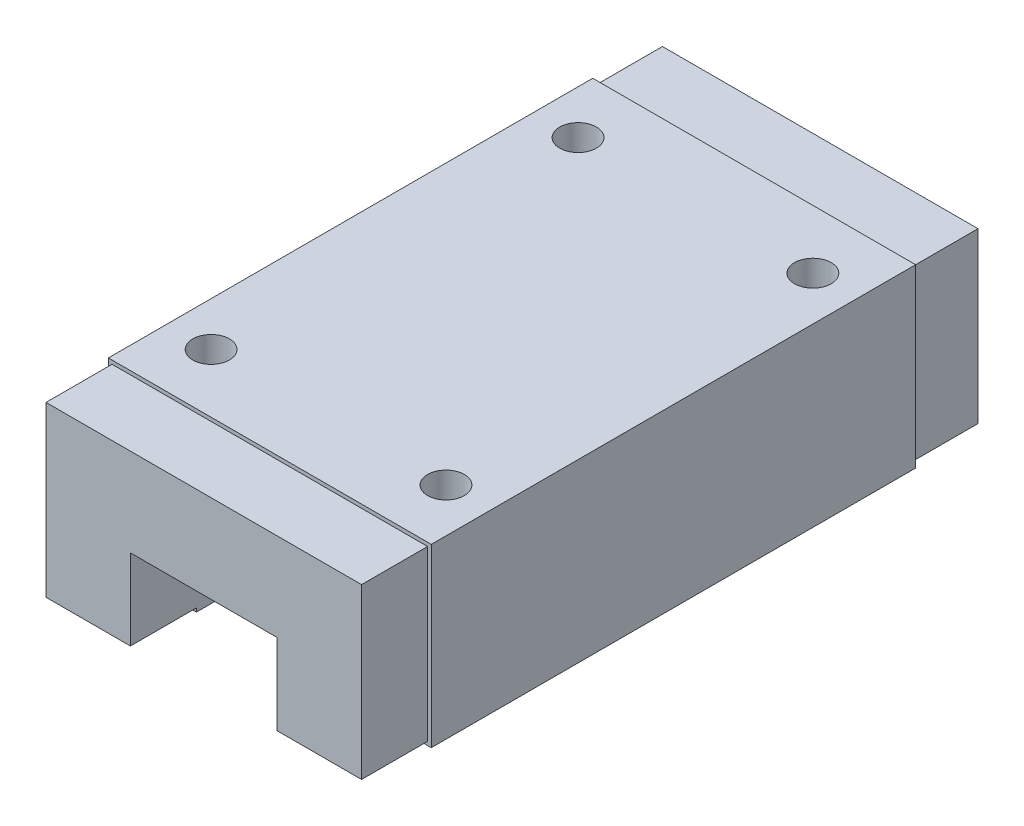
ISO-10303-21;
HEADER;
FILE_DESCRIPTION(('STEP AP214'),'2;1');
FILE_NAME('part.step','',(''),(''),'','','');
FILE_SCHEMA(('AUTOMOTIVE_DESIGN { 1 0 10303 214 1 1 1 1 }'));
ENDSEC;
DATA;
#1=APPLICATION_CONTEXT('core data for automotive mechanical design processes');
#2=APPLICATION_PROTOCOL_DEFINITION('international standard','automotive_design',2000,#1);
#3=PRODUCT_CONTEXT('',#1,'mechanical');
#4=PRODUCT('Part','Part','',(#3));
#5=PRODUCT_RELATED_PRODUCT_CATEGORY('part','',(#4));
#6=PRODUCT_DEFINITION_FORMATION('','',#4);
#7=PRODUCT_DEFINITION_CONTEXT('part definition',#1,'design');
#8=PRODUCT_DEFINITION('design','',#6,#7);
#9=PRODUCT_DEFINITION_SHAPE('','',#8);
#10=(LENGTH_UNIT() NAMED_UNIT(*) SI_UNIT(.MILLI.,.METRE.));
#11=(NAMED_UNIT(*) PLANE_ANGLE_UNIT() SI_UNIT($,.RADIAN.));
#12=(NAMED_UNIT(*) SI_UNIT($,.STERADIAN.) SOLID_ANGLE_UNIT());
#13=UNCERTAINTY_MEASURE_WITH_UNIT(LENGTH_MEASURE(1.E-05),#10,'distance_accuracy_value','');
#14=(GEOMETRIC_REPRESENTATION_CONTEXT(3) GLOBAL_UNCERTAINTY_ASSIGNED_CONTEXT((#13)) GLOBAL_UNIT_ASSIGNED_CONTEXT((#10,
#11,#12)) REPRESENTATION_CONTEXT('',''));
#15=CARTESIAN_POINT('',(0.,0.,0.));
#16=DIRECTION('',(0.,0.,1.));
#17=DIRECTION('',(1.,0.,0.));
#18=AXIS2_PLACEMENT_3D('',#15,#16,#17);
#19=CARTESIAN_POINT('',(-21.9999999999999,-12.,32.9999999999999));
#20=DIRECTION('',(0.,1.,0.));
#21=DIRECTION('',(0.,0.,0.999999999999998));
#22=AXIS2_PLACEMENT_3D('',#19,#20,#21);
#23=PLANE('',#22);
#24=DIRECTION('',(-0.999999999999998,0.,0.));
#25=VECTOR('',#24,1.);
#26=CARTESIAN_POINT('',(-22.,-12.,-32.9999999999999));
#27=LINE('',#26,#25);
#28=CARTESIAN_POINT('',(-9.99999999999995,-12.,-32.9999999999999));
#29=VERTEX_POINT('',#28);
#30=CARTESIAN_POINT('',(-22.,-12.,-32.9999999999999));
#31=VERTEX_POINT('',#30);
#32=EDGE_CURVE('E363',#29,#31,#27,.T.);
#33=ORIENTED_EDGE('',*,*,#32,.F.);
#34=DIRECTION('',(0.,0.,0.999999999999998));
#35=VECTOR('',#34,1.);
#36=CARTESIAN_POINT('',(-9.99999999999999,-12.,-42.0009999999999));
#37=LINE('',#36,#35);
#38=CARTESIAN_POINT('',(-9.99999999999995,-12.,32.9999999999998));
#39=VERTEX_POINT('',#38);
#40=EDGE_CURVE('E261',#29,#39,#37,.T.);
#41=ORIENTED_EDGE('',*,*,#40,.T.);
#42=DIRECTION('',(0.999999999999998,0.,0.));
#43=VECTOR('',#42,1.);
#44=CARTESIAN_POINT('',(-21.9999999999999,-12.,32.9999999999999));
#45=LINE('',#44,#43);
#46=CARTESIAN_POINT('',(-21.9999999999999,-12.,32.9999999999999));
#47=VERTEX_POINT('',#46);
#48=EDGE_CURVE('E358',#47,#39,#45,.T.);
#49=ORIENTED_EDGE('',*,*,#48,.F.);
#50=DIRECTION('',(0.,0.,0.999999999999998));
#51=VECTOR('',#50,1.);
#52=CARTESIAN_POINT('',(-22.,-12.,-32.9999999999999));
#53=LINE('',#52,#51);
#54=EDGE_CURVE('E343',#31,#47,#53,.T.);
#55=ORIENTED_EDGE('',*,*,#54,.F.);
#56=EDGE_LOOP('',(#33,#41,#49,#55));
#57=FACE_BOUND('',#56,.T.);
#58=ADVANCED_FACE('F31',(#57),#23,.F.);
#59=CARTESIAN_POINT('',(-21.5,-11.5000000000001,41.9999999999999));
#60=DIRECTION('',(0.,1.,0.));
#61=DIRECTION('',(0.,0.,0.999999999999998));
#62=AXIS2_PLACEMENT_3D('',#59,#60,#61);
#63=PLANE('',#62);
#64=DIRECTION('',(0.999999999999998,0.,0.));
#65=VECTOR('',#64,1.);
#66=CARTESIAN_POINT('',(-21.4999999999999,-11.5,32.9999999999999));
#67=LINE('',#66,#65);
#68=CARTESIAN_POINT('',(-21.4999999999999,-11.5,32.9999999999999));
#69=VERTEX_POINT('',#68);
#70=CARTESIAN_POINT('',(-9.99999999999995,-11.5,32.9999999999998));
#71=VERTEX_POINT('',#70);
#72=EDGE_CURVE('E324',#69,#71,#67,.T.);
#73=ORIENTED_EDGE('',*,*,#72,.T.);
#74=DIRECTION('',(0.,0.,-0.999999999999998));
#75=VECTOR('',#74,1.);
#76=CARTESIAN_POINT('',(-9.99999999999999,-11.5,-42.0009999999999));
#77=LINE('',#76,#75);
#78=CARTESIAN_POINT('',(-9.99999999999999,-11.5,41.9999999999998));
#79=VERTEX_POINT('',#78);
#80=EDGE_CURVE('E237',#79,#71,#77,.T.);
#81=ORIENTED_EDGE('',*,*,#80,.F.);
#82=DIRECTION('',(0.999999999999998,0.,0.));
#83=VECTOR('',#82,1.);
#84=CARTESIAN_POINT('',(-21.5,-11.5000000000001,41.9999999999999));
#85=LINE('',#84,#83);
#86=CARTESIAN_POINT('',(-21.5,-11.5000000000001,41.9999999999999));
#87=VERTEX_POINT('',#86);
#88=EDGE_CURVE('E313',#87,#79,#85,.T.);
#89=ORIENTED_EDGE('',*,*,#88,.F.);
#90=DIRECTION('',(0.,0.,-0.999999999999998));
#91=VECTOR('',#90,1.);
#92=CARTESIAN_POINT('',(-21.5,-11.5000000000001,41.9999999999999));
#93=LINE('',#92,#91);
#94=EDGE_CURVE('E340',#87,#69,#93,.T.);
#95=ORIENTED_EDGE('',*,*,#94,.T.);
#96=EDGE_LOOP('',(#73,#81,#89,#95));
#97=FACE_BOUND('',#96,.T.);
#98=ADVANCED_FACE('F439',(#97),#63,.F.);
#99=CARTESIAN_POINT('',(-21.5,-11.4999999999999,-41.9999999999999));
#100=DIRECTION('',(0.,1.,0.));
#101=DIRECTION('',(-0.999999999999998,0.,0.));
#102=AXIS2_PLACEMENT_3D('',#99,#100,#101);
#103=PLANE('',#102);
#104=DIRECTION('',(-0.999999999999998,0.,0.));
#105=VECTOR('',#104,1.);
#106=CARTESIAN_POINT('',(-21.5,-11.4999999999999,-41.9999999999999));
#107=LINE('',#106,#105);
#108=CARTESIAN_POINT('',(-9.99999999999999,-11.5,-41.9999999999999));
#109=VERTEX_POINT('',#108);
#110=CARTESIAN_POINT('',(-21.5,-11.4999999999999,-41.9999999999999));
#111=VERTEX_POINT('',#110);
#112=EDGE_CURVE('E283',#109,#111,#107,.T.);
#113=ORIENTED_EDGE('',*,*,#112,.F.);
#114=DIRECTION('',(0.,0.,-0.999999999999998));
#115=VECTOR('',#114,1.);
#116=CARTESIAN_POINT('',(-9.99999999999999,-11.5,-42.0009999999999));
#117=LINE('',#116,#115);
#118=CARTESIAN_POINT('',(-9.99999999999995,-11.5,-32.9999999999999));
#119=VERTEX_POINT('',#118);
#120=EDGE_CURVE('E251',#119,#109,#117,.T.);
#121=ORIENTED_EDGE('',*,*,#120,.F.);
#122=DIRECTION('',(-0.999999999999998,0.,0.));
#123=VECTOR('',#122,1.);
#124=CARTESIAN_POINT('',(-21.5,-11.5,-32.9999999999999));
#125=LINE('',#124,#123);
#126=CARTESIAN_POINT('',(-21.5,-11.5,-32.9999999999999));
#127=VERTEX_POINT('',#126);
#128=EDGE_CURVE('E294',#119,#127,#125,.T.);
#129=ORIENTED_EDGE('',*,*,#128,.T.);
#130=DIRECTION('',(0.,0.,0.999999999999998));
#131=VECTOR('',#130,1.);
#132=CARTESIAN_POINT('',(-21.5,-11.4999999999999,-41.9999999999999));
#133=LINE('',#132,#131);
#134=EDGE_CURVE('E287',#111,#127,#133,.T.);
#135=ORIENTED_EDGE('',*,*,#134,.F.);
#136=EDGE_LOOP('',(#113,#121,#129,#135));
#137=FACE_BOUND('',#136,.T.);
#138=ADVANCED_FACE('F405',(#137),#103,.F.);
#139=CARTESIAN_POINT('',(-22.,12.,-32.9999999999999));
#140=DIRECTION('',(0.,0.,0.999999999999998));
#141=DIRECTION('',(0.999999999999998,0.,0.));
#142=AXIS2_PLACEMENT_3D('',#139,#140,#141);
#143=PLANE('',#142);
#144=ORIENTED_EDGE('',*,*,#128,.F.);
#145=DIRECTION('',(0.,1.,0.));
#146=VECTOR('',#145,1.);
#147=CARTESIAN_POINT('',(-10.,-0.499999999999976,-32.9999999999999));
#148=LINE('',#147,#146);
#149=EDGE_CURVE('E245',#29,#119,#148,.T.);
#150=ORIENTED_EDGE('',*,*,#149,.F.);
#151=ORIENTED_EDGE('',*,*,#32,.T.);
#152=DIRECTION('',(0.,-1.,0.));
#153=VECTOR('',#152,1.);
#154=CARTESIAN_POINT('',(-22.,12.,-32.9999999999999));
#155=LINE('',#154,#153);
#156=CARTESIAN_POINT('',(-22.,12.,-32.9999999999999));
#157=VERTEX_POINT('',#156);
#158=EDGE_CURVE('E354',#157,#31,#155,.T.);
#159=ORIENTED_EDGE('',*,*,#158,.F.);
#160=DIRECTION('',(-0.999999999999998,0.,0.));
#161=VECTOR('',#160,1.);
#162=CARTESIAN_POINT('',(-22.,12.,-32.9999999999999));
#163=LINE('',#162,#161);
#164=CARTESIAN_POINT('',(22.,12.,-33.));
#165=VERTEX_POINT('',#164);
#166=EDGE_CURVE('E352',#165,#157,#163,.T.);
#167=ORIENTED_EDGE('',*,*,#166,.F.);
#168=DIRECTION('',(0.,-1.,0.));
#169=VECTOR('',#168,1.);
#170=CARTESIAN_POINT('',(22.,12.,-33.));
#171=LINE('',#170,#169);
#172=CARTESIAN_POINT('',(22.,-12.,-32.9999999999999));
#173=VERTEX_POINT('',#172);
#174=EDGE_CURVE('E368',#165,#173,#171,.T.);
#175=ORIENTED_EDGE('',*,*,#174,.T.);
#176=CARTESIAN_POINT('',(9.99999999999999,-12.,-32.9999999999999));
#177=VERTEX_POINT('',#176);
#178=EDGE_CURVE('E348',#173,#177,#27,.T.);
#179=ORIENTED_EDGE('',*,*,#178,.T.);
#180=DIRECTION('',(0.,-1.,0.));
#181=VECTOR('',#180,1.);
#182=CARTESIAN_POINT('',(9.99999999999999,-0.499999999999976,-32.9999999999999));
#183=LINE('',#182,#181);
#184=CARTESIAN_POINT('',(9.99999999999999,-11.4999999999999,-32.9999999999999));
#185=VERTEX_POINT('',#184);
#186=EDGE_CURVE('E243',#185,#177,#183,.T.);
#187=ORIENTED_EDGE('',*,*,#186,.F.);
#188=CARTESIAN_POINT('',(21.5,-11.5,-32.9999999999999));
#189=VERTEX_POINT('',#188);
#190=EDGE_CURVE('E279',#189,#185,#125,.T.);
#191=ORIENTED_EDGE('',*,*,#190,.F.);
#192=DIRECTION('',(0.,-1.,0.));
#193=VECTOR('',#192,1.);
#194=CARTESIAN_POINT('',(21.4999999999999,11.5,-33.));
#195=LINE('',#194,#193);
#196=CARTESIAN_POINT('',(21.5,11.5,-33.));
#197=VERTEX_POINT('',#196);
#198=EDGE_CURVE('E291',#197,#189,#195,.T.);
#199=ORIENTED_EDGE('',*,*,#198,.F.);
#200=DIRECTION('',(0.999999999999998,0.,0.));
#201=VECTOR('',#200,1.);
#202=CARTESIAN_POINT('',(-21.5,11.5,-32.9999999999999));
#203=LINE('',#202,#201);
#204=CARTESIAN_POINT('',(-21.5,11.5,-32.9999999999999));
#205=VERTEX_POINT('',#204);
#206=EDGE_CURVE('E54',#205,#197,#203,.T.);
#207=ORIENTED_EDGE('',*,*,#206,.F.);
#208=DIRECTION('',(0.,1.,0.));
#209=VECTOR('',#208,1.);
#210=CARTESIAN_POINT('',(-21.5,11.5,-32.9999999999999));
#211=LINE('',#210,#209);
#212=EDGE_CURVE('E274',#127,#205,#211,.T.);
#213=ORIENTED_EDGE('',*,*,#212,.F.);
#214=EDGE_LOOP('',(#144,#150,#151,#159,#167,#175,#179,#187,#191,#199,#207,#213));
#215=FACE_BOUND('',#214,.T.);
#216=ADVANCED_FACE('F385',(#215),#143,.F.);
#217=CARTESIAN_POINT('',(-21.9999999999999,12.,32.9999999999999));
#218=DIRECTION('',(0.,0.,-0.999999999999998));
#219=DIRECTION('',(-0.999999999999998,0.,0.));
#220=AXIS2_PLACEMENT_3D('',#217,#218,#219);
#221=PLANE('',#220);
#222=ORIENTED_EDGE('',*,*,#48,.T.);
#223=DIRECTION('',(0.,-1.,0.));
#224=VECTOR('',#223,1.);
#225=CARTESIAN_POINT('',(-10.,-0.500000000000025,32.9999999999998));
#226=LINE('',#225,#224);
#227=EDGE_CURVE('E241',#71,#39,#226,.T.);
#228=ORIENTED_EDGE('',*,*,#227,.F.);
#229=ORIENTED_EDGE('',*,*,#72,.F.);
#230=DIRECTION('',(0.,-1.,0.));
#231=VECTOR('',#230,1.);
#232=CARTESIAN_POINT('',(-21.5,11.5,32.9999999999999));
#233=LINE('',#232,#231);
#234=CARTESIAN_POINT('',(-21.5,11.5,32.9999999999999));
#235=VERTEX_POINT('',#234);
#236=EDGE_CURVE('E307',#235,#69,#233,.T.);
#237=ORIENTED_EDGE('',*,*,#236,.F.);
#238=DIRECTION('',(-0.999999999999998,0.,0.));
#239=VECTOR('',#238,1.);
#240=CARTESIAN_POINT('',(-21.5,11.5,32.9999999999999));
#241=LINE('',#240,#239);
#242=CARTESIAN_POINT('',(21.4999999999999,11.5,32.9999999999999));
#243=VERTEX_POINT('',#242);
#244=EDGE_CURVE('E312',#243,#235,#241,.T.);
#245=ORIENTED_EDGE('',*,*,#244,.F.);
#246=DIRECTION('',(0.,1.,0.));
#247=VECTOR('',#246,1.);
#248=CARTESIAN_POINT('',(21.4999999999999,11.5,32.9999999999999));
#249=LINE('',#248,#247);
#250=CARTESIAN_POINT('',(21.4999999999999,-11.5,32.9999999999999));
#251=VERTEX_POINT('',#250);
#252=EDGE_CURVE('E327',#251,#243,#249,.T.);
#253=ORIENTED_EDGE('',*,*,#252,.F.);
#254=CARTESIAN_POINT('',(9.99999999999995,-11.5,32.9999999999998));
#255=VERTEX_POINT('',#254);
#256=EDGE_CURVE('E323',#255,#251,#67,.T.);
#257=ORIENTED_EDGE('',*,*,#256,.F.);
#258=DIRECTION('',(0.,1.,0.));
#259=VECTOR('',#258,1.);
#260=CARTESIAN_POINT('',(9.99999999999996,-0.500000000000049,32.9999999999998));
#261=LINE('',#260,#259);
#262=CARTESIAN_POINT('',(9.99999999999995,-12.,32.9999999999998));
#263=VERTEX_POINT('',#262);
#264=EDGE_CURVE('E239',#263,#255,#261,.T.);
#265=ORIENTED_EDGE('',*,*,#264,.F.);
#266=CARTESIAN_POINT('',(22.,-12.,32.9999999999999));
#267=VERTEX_POINT('',#266);
#268=EDGE_CURVE('E357',#263,#267,#45,.T.);
#269=ORIENTED_EDGE('',*,*,#268,.T.);
#270=DIRECTION('',(0.,-1.,0.));
#271=VECTOR('',#270,1.);
#272=CARTESIAN_POINT('',(21.9999999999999,12.,32.9999999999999));
#273=LINE('',#272,#271);
#274=CARTESIAN_POINT('',(21.9999999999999,12.,32.9999999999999));
#275=VERTEX_POINT('',#274);
#276=EDGE_CURVE('E39',#275,#267,#273,.T.);
#277=ORIENTED_EDGE('',*,*,#276,.F.);
#278=DIRECTION('',(0.999999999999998,0.,0.));
#279=VECTOR('',#278,1.);
#280=CARTESIAN_POINT('',(-21.9999999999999,12.,32.9999999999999));
#281=LINE('',#280,#279);
#282=CARTESIAN_POINT('',(-21.9999999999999,12.,32.9999999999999));
#283=VERTEX_POINT('',#282);
#284=EDGE_CURVE('E347',#283,#275,#281,.T.);
#285=ORIENTED_EDGE('',*,*,#284,.F.);
#286=DIRECTION('',(0.,-1.,0.));
#287=VECTOR('',#286,1.);
#288=CARTESIAN_POINT('',(-21.9999999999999,12.,32.9999999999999));
#289=LINE('',#288,#287);
#290=EDGE_CURVE('E11',#283,#47,#289,.T.);
#291=ORIENTED_EDGE('',*,*,#290,.T.);
#292=EDGE_LOOP('',(#222,#228,#229,#237,#245,#253,#257,#265,#269,#277,#285,#291));
#293=FACE_BOUND('',#292,.T.);
#294=ADVANCED_FACE('F392',(#293),#221,.F.);
#295=CARTESIAN_POINT('',(-22.,12.,-32.9999999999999));
#296=DIRECTION('',(0.999999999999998,0.,0.));
#297=DIRECTION('',(0.,0.,-0.999999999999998));
#298=AXIS2_PLACEMENT_3D('',#295,#296,#297);
#299=PLANE('',#298);
#300=ORIENTED_EDGE('',*,*,#54,.T.);
#301=ORIENTED_EDGE('',*,*,#290,.F.);
#302=DIRECTION('',(0.,0.,0.999999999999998));
#303=VECTOR('',#302,1.);
#304=CARTESIAN_POINT('',(-22.,12.,-32.9999999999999));
#305=LINE('',#304,#303);
#306=EDGE_CURVE('E344',#157,#283,#305,.T.);
#307=ORIENTED_EDGE('',*,*,#306,.F.);
#308=ORIENTED_EDGE('',*,*,#158,.T.);
#309=EDGE_LOOP('',(#300,#301,#307,#308));
#310=FACE_BOUND('',#309,.T.);
#311=ADVANCED_FACE('F33',(#310),#299,.F.);
#312=CARTESIAN_POINT('',(22.,12.,-33.));
#313=DIRECTION('',(-0.999999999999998,0.,0.));
#314=DIRECTION('',(0.,0.,0.999999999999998));
#315=AXIS2_PLACEMENT_3D('',#312,#313,#314);
#316=PLANE('',#315);
#317=DIRECTION('',(0.,0.,-0.999999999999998));
#318=VECTOR('',#317,1.);
#319=CARTESIAN_POINT('',(22.,-12.,-32.9999999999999));
#320=LINE('',#319,#318);
#321=EDGE_CURVE('E361',#267,#173,#320,.T.);
#322=ORIENTED_EDGE('',*,*,#321,.T.);
#323=ORIENTED_EDGE('',*,*,#174,.F.);
#324=DIRECTION('',(0.,0.,-0.999999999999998));
#325=VECTOR('',#324,1.);
#326=CARTESIAN_POINT('',(22.,12.,-33.));
#327=LINE('',#326,#325);
#328=EDGE_CURVE('E350',#275,#165,#327,.T.);
#329=ORIENTED_EDGE('',*,*,#328,.F.);
#330=ORIENTED_EDGE('',*,*,#276,.T.);
#331=EDGE_LOOP('',(#322,#323,#329,#330));
#332=FACE_BOUND('',#331,.T.);
#333=ADVANCED_FACE('F375',(#332),#316,.F.);
#334=CARTESIAN_POINT('',(-21.9999999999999,12.,32.9999999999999));
#335=DIRECTION('',(0.,1.,0.));
#336=DIRECTION('',(0.,0.,0.999999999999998));
#337=AXIS2_PLACEMENT_3D('',#334,#335,#336);
#338=PLANE('',#337);
#339=CARTESIAN_POINT('',(-16.,12.,-25.));
#340=DIRECTION('',(0.,1.,0.));
#341=DIRECTION('',(0.,0.,0.999999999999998));
#342=AXIS2_PLACEMENT_3D('',#339,#340,#341);
#343=CIRCLE('',#342,2.5);
#344=CARTESIAN_POINT('',(-16.,12.,-22.5));
#345=VERTEX_POINT('',#344);
#346=EDGE_CURVE('E196',#345,#345,#343,.T.);
#347=ORIENTED_EDGE('',*,*,#346,.F.);
#348=EDGE_LOOP('',(#347));
#349=FACE_BOUND('',#348,.T.);
#350=CARTESIAN_POINT('',(15.9999999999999,12.,-25.));
#351=DIRECTION('',(0.,1.,0.));
#352=DIRECTION('',(0.,0.,0.999999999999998));
#353=AXIS2_PLACEMENT_3D('',#350,#351,#352);
#354=CIRCLE('',#353,2.5);
#355=CARTESIAN_POINT('',(15.9999999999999,12.,-22.5));
#356=VERTEX_POINT('',#355);
#357=EDGE_CURVE('E208',#356,#356,#354,.T.);
#358=ORIENTED_EDGE('',*,*,#357,.F.);
#359=EDGE_LOOP('',(#358));
#360=FACE_BOUND('',#359,.T.);
#361=CARTESIAN_POINT('',(16.,12.,25.));
#362=DIRECTION('',(0.,1.,0.));
#363=DIRECTION('',(0.,0.,0.999999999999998));
#364=AXIS2_PLACEMENT_3D('',#361,#362,#363);
#365=CIRCLE('',#364,2.5);
#366=CARTESIAN_POINT('',(16.,12.,27.5));
#367=VERTEX_POINT('',#366);
#368=EDGE_CURVE('E220',#367,#367,#365,.T.);
#369=ORIENTED_EDGE('',*,*,#368,.F.);
#370=EDGE_LOOP('',(#369));
#371=FACE_BOUND('',#370,.T.);
#372=CARTESIAN_POINT('',(-16.,12.,24.9999999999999));
#373=DIRECTION('',(0.,1.,0.));
#374=DIRECTION('',(0.,0.,0.999999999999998));
#375=AXIS2_PLACEMENT_3D('',#372,#373,#374);
#376=CIRCLE('',#375,2.5);
#377=CARTESIAN_POINT('',(-16.,12.,27.4999999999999));
#378=VERTEX_POINT('',#377);
#379=EDGE_CURVE('E232',#378,#378,#376,.T.);
#380=ORIENTED_EDGE('',*,*,#379,.F.);
#381=EDGE_LOOP('',(#380));
#382=FACE_BOUND('',#381,.T.);
#383=ORIENTED_EDGE('',*,*,#306,.T.);
#384=ORIENTED_EDGE('',*,*,#284,.T.);
#385=ORIENTED_EDGE('',*,*,#328,.T.);
#386=ORIENTED_EDGE('',*,*,#166,.T.);
#387=EDGE_LOOP('',(#383,#384,#385,#386));
#388=FACE_BOUND('',#387,.T.);
#389=ADVANCED_FACE('F390',(#349,#360,#371,#382,#388),#338,.T.);
#390=ORIENTED_EDGE('',*,*,#268,.F.);
#391=DIRECTION('',(0.,0.,0.999999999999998));
#392=VECTOR('',#391,1.);
#393=CARTESIAN_POINT('',(9.99999999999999,-12.,-42.0009999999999));
#394=LINE('',#393,#392);
#395=EDGE_CURVE('E267',#177,#263,#394,.T.);
#396=ORIENTED_EDGE('',*,*,#395,.F.);
#397=ORIENTED_EDGE('',*,*,#178,.F.);
#398=ORIENTED_EDGE('',*,*,#321,.F.);
#399=EDGE_LOOP('',(#390,#396,#397,#398));
#400=FACE_BOUND('',#399,.T.);
#401=ADVANCED_FACE('F381',(#400),#23,.F.);
#402=CARTESIAN_POINT('',(-21.5,11.5,41.9999999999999));
#403=DIRECTION('',(0.999999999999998,0.,0.));
#404=DIRECTION('',(0.,1.,0.));
#405=AXIS2_PLACEMENT_3D('',#402,#403,#404);
#406=PLANE('',#405);
#407=ORIENTED_EDGE('',*,*,#236,.T.);
#408=ORIENTED_EDGE('',*,*,#94,.F.);
#409=DIRECTION('',(0.,-1.,0.));
#410=VECTOR('',#409,1.);
#411=CARTESIAN_POINT('',(-21.5,11.5,41.9999999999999));
#412=LINE('',#411,#410);
#413=CARTESIAN_POINT('',(-21.5,11.5,41.9999999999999));
#414=VERTEX_POINT('',#413);
#415=EDGE_CURVE('E308',#414,#87,#412,.T.);
#416=ORIENTED_EDGE('',*,*,#415,.F.);
#417=DIRECTION('',(0.,0.,-0.999999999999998));
#418=VECTOR('',#417,1.);
#419=CARTESIAN_POINT('',(-21.5,11.5,41.9999999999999));
#420=LINE('',#419,#418);
#421=EDGE_CURVE('E320',#414,#235,#420,.T.);
#422=ORIENTED_EDGE('',*,*,#421,.T.);
#423=EDGE_LOOP('',(#407,#408,#416,#422));
#424=FACE_BOUND('',#423,.T.);
#425=ADVANCED_FACE('F450',(#424),#406,.F.);
#426=CARTESIAN_POINT('',(9.99999999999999,-11.5,41.9999999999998));
#427=VERTEX_POINT('',#426);
#428=CARTESIAN_POINT('',(21.5,-11.5,41.9999999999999));
#429=VERTEX_POINT('',#428);
#430=EDGE_CURVE('E311',#427,#429,#85,.T.);
#431=ORIENTED_EDGE('',*,*,#430,.F.);
#432=DIRECTION('',(0.,0.,0.999999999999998));
#433=VECTOR('',#432,1.);
#434=CARTESIAN_POINT('',(9.99999999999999,-11.5,-42.0009999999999));
#435=LINE('',#434,#433);
#436=EDGE_CURVE('E235',#255,#427,#435,.T.);
#437=ORIENTED_EDGE('',*,*,#436,.F.);
#438=ORIENTED_EDGE('',*,*,#256,.T.);
#439=DIRECTION('',(0.,0.,-0.999999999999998));
#440=VECTOR('',#439,1.);
#441=CARTESIAN_POINT('',(21.5,-11.5,41.9999999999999));
#442=LINE('',#441,#440);
#443=EDGE_CURVE('E337',#429,#251,#442,.T.);
#444=ORIENTED_EDGE('',*,*,#443,.F.);
#445=EDGE_LOOP('',(#431,#437,#438,#444));
#446=FACE_BOUND('',#445,.T.);
#447=ADVANCED_FACE('F446',(#446),#63,.F.);
#448=CARTESIAN_POINT('',(21.5,11.5,41.9999999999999));
#449=DIRECTION('',(-0.999999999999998,0.,0.));
#450=DIRECTION('',(0.,-1.,0.));
#451=AXIS2_PLACEMENT_3D('',#448,#449,#450);
#452=PLANE('',#451);
#453=ORIENTED_EDGE('',*,*,#252,.T.);
#454=DIRECTION('',(0.,0.,-0.999999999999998));
#455=VECTOR('',#454,1.);
#456=CARTESIAN_POINT('',(21.5,11.5,41.9999999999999));
#457=LINE('',#456,#455);
#458=CARTESIAN_POINT('',(21.5,11.5,41.9999999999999));
#459=VERTEX_POINT('',#458);
#460=EDGE_CURVE('E334',#459,#243,#457,.T.);
#461=ORIENTED_EDGE('',*,*,#460,.F.);
#462=DIRECTION('',(0.,1.,0.));
#463=VECTOR('',#462,1.);
#464=CARTESIAN_POINT('',(21.5,11.5,41.9999999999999));
#465=LINE('',#464,#463);
#466=EDGE_CURVE('E316',#429,#459,#465,.T.);
#467=ORIENTED_EDGE('',*,*,#466,.F.);
#468=ORIENTED_EDGE('',*,*,#443,.T.);
#469=EDGE_LOOP('',(#453,#461,#467,#468));
#470=FACE_BOUND('',#469,.T.);
#471=ADVANCED_FACE('F466',(#470),#452,.F.);
#472=CARTESIAN_POINT('',(-21.5,11.5,41.9999999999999));
#473=DIRECTION('',(0.,-1.,0.));
#474=DIRECTION('',(0.,0.,-0.999999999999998));
#475=AXIS2_PLACEMENT_3D('',#472,#473,#474);
#476=PLANE('',#475);
#477=ORIENTED_EDGE('',*,*,#244,.T.);
#478=ORIENTED_EDGE('',*,*,#421,.F.);
#479=DIRECTION('',(-0.999999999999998,0.,0.));
#480=VECTOR('',#479,1.);
#481=CARTESIAN_POINT('',(-21.5,11.5,41.9999999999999));
#482=LINE('',#481,#480);
#483=EDGE_CURVE('E318',#459,#414,#482,.T.);
#484=ORIENTED_EDGE('',*,*,#483,.F.);
#485=ORIENTED_EDGE('',*,*,#460,.T.);
#486=EDGE_LOOP('',(#477,#478,#484,#485));
#487=FACE_BOUND('',#486,.T.);
#488=ADVANCED_FACE('F435',(#487),#476,.F.);
#489=CARTESIAN_POINT('',(-21.5,-11.5000000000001,41.9999999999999));
#490=DIRECTION('',(0.,0.,0.999999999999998));
#491=DIRECTION('',(0.999999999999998,0.,0.));
#492=AXIS2_PLACEMENT_3D('',#489,#490,#491);
#493=PLANE('',#492);
#494=DIRECTION('',(0.,-1.,0.));
#495=VECTOR('',#494,1.);
#496=CARTESIAN_POINT('',(-10.,-0.500000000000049,41.9999999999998));
#497=LINE('',#496,#495);
#498=CARTESIAN_POINT('',(-10.,-0.500000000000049,41.9999999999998));
#499=VERTEX_POINT('',#498);
#500=EDGE_CURVE('E253',#499,#79,#497,.T.);
#501=ORIENTED_EDGE('',*,*,#500,.F.);
#502=DIRECTION('',(-0.999999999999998,0.,0.));
#503=VECTOR('',#502,1.);
#504=CARTESIAN_POINT('',(-10.,-0.500000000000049,41.9999999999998));
#505=LINE('',#504,#503);
#506=CARTESIAN_POINT('',(10.,-0.500000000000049,41.9999999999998));
#507=VERTEX_POINT('',#506);
#508=EDGE_CURVE('E258',#507,#499,#505,.T.);
#509=ORIENTED_EDGE('',*,*,#508,.F.);
#510=DIRECTION('',(0.,1.,0.));
#511=VECTOR('',#510,1.);
#512=CARTESIAN_POINT('',(10.,-0.500000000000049,41.9999999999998));
#513=LINE('',#512,#511);
#514=EDGE_CURVE('E255',#427,#507,#513,.T.);
#515=ORIENTED_EDGE('',*,*,#514,.F.);
#516=ORIENTED_EDGE('',*,*,#430,.T.);
#517=ORIENTED_EDGE('',*,*,#466,.T.);
#518=ORIENTED_EDGE('',*,*,#483,.T.);
#519=ORIENTED_EDGE('',*,*,#415,.T.);
#520=ORIENTED_EDGE('',*,*,#88,.T.);
#521=EDGE_LOOP('',(#501,#509,#515,#516,#517,#518,#519,#520));
#522=FACE_BOUND('',#521,.T.);
#523=ADVANCED_FACE('F428',(#522),#493,.T.);
#524=CARTESIAN_POINT('',(-21.5,11.5,-41.9999999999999));
#525=DIRECTION('',(0.999999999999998,0.,0.));
#526=DIRECTION('',(0.,0.,-0.999999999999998));
#527=AXIS2_PLACEMENT_3D('',#524,#525,#526);
#528=PLANE('',#527);
#529=ORIENTED_EDGE('',*,*,#212,.T.);
#530=DIRECTION('',(0.,0.,0.999999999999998));
#531=VECTOR('',#530,1.);
#532=CARTESIAN_POINT('',(-21.5,11.5,-41.9999999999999));
#533=LINE('',#532,#531);
#534=CARTESIAN_POINT('',(-21.5,11.5,-41.9999999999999));
#535=VERTEX_POINT('',#534);
#536=EDGE_CURVE('E305',#535,#205,#533,.T.);
#537=ORIENTED_EDGE('',*,*,#536,.F.);
#538=DIRECTION('',(0.,1.,0.));
#539=VECTOR('',#538,1.);
#540=CARTESIAN_POINT('',(-21.5,11.5,-41.9999999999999));
#541=LINE('',#540,#539);
#542=EDGE_CURVE('E275',#111,#535,#541,.T.);
#543=ORIENTED_EDGE('',*,*,#542,.F.);
#544=ORIENTED_EDGE('',*,*,#134,.T.);
#545=EDGE_LOOP('',(#529,#537,#543,#544));
#546=FACE_BOUND('',#545,.T.);
#547=ADVANCED_FACE('F426',(#546),#528,.F.);
#548=CARTESIAN_POINT('',(-21.5,11.5,-41.9999999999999));
#549=DIRECTION('',(0.,-1.,0.));
#550=DIRECTION('',(0.999999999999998,0.,0.));
#551=AXIS2_PLACEMENT_3D('',#548,#549,#550);
#552=PLANE('',#551);
#553=ORIENTED_EDGE('',*,*,#206,.T.);
#554=DIRECTION('',(0.,0.,0.999999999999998));
#555=VECTOR('',#554,1.);
#556=CARTESIAN_POINT('',(21.4999999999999,11.5,-42.));
#557=LINE('',#556,#555);
#558=CARTESIAN_POINT('',(21.4999999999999,11.5,-42.));
#559=VERTEX_POINT('',#558);
#560=EDGE_CURVE('E302',#559,#197,#557,.T.);
#561=ORIENTED_EDGE('',*,*,#560,.F.);
#562=DIRECTION('',(0.999999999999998,0.,0.));
#563=VECTOR('',#562,1.);
#564=CARTESIAN_POINT('',(-21.5,11.5,-41.9999999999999));
#565=LINE('',#564,#563);
#566=EDGE_CURVE('E278',#535,#559,#565,.T.);
#567=ORIENTED_EDGE('',*,*,#566,.F.);
#568=ORIENTED_EDGE('',*,*,#536,.T.);
#569=EDGE_LOOP('',(#553,#561,#567,#568));
#570=FACE_BOUND('',#569,.T.);
#571=ADVANCED_FACE('F423',(#570),#552,.F.);
#572=CARTESIAN_POINT('',(21.4999999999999,11.5,-42.));
#573=DIRECTION('',(-0.999999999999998,0.,0.));
#574=DIRECTION('',(0.,-1.,0.));
#575=AXIS2_PLACEMENT_3D('',#572,#573,#574);
#576=PLANE('',#575);
#577=ORIENTED_EDGE('',*,*,#198,.T.);
#578=DIRECTION('',(0.,0.,0.999999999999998));
#579=VECTOR('',#578,1.);
#580=CARTESIAN_POINT('',(21.5,-11.5,-41.9999999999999));
#581=LINE('',#580,#579);
#582=CARTESIAN_POINT('',(21.5,-11.5,-41.9999999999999));
#583=VERTEX_POINT('',#582);
#584=EDGE_CURVE('E299',#583,#189,#581,.T.);
#585=ORIENTED_EDGE('',*,*,#584,.F.);
#586=DIRECTION('',(0.,-1.,0.));
#587=VECTOR('',#586,1.);
#588=CARTESIAN_POINT('',(21.4999999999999,11.5,-42.));
#589=LINE('',#588,#587);
#590=EDGE_CURVE('E281',#559,#583,#589,.T.);
#591=ORIENTED_EDGE('',*,*,#590,.F.);
#592=ORIENTED_EDGE('',*,*,#560,.T.);
#593=EDGE_LOOP('',(#577,#585,#591,#592));
#594=FACE_BOUND('',#593,.T.);
#595=ADVANCED_FACE('F419',(#594),#576,.F.);
#596=ORIENTED_EDGE('',*,*,#190,.T.);
#597=DIRECTION('',(0.,0.,0.999999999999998));
#598=VECTOR('',#597,1.);
#599=CARTESIAN_POINT('',(9.99999999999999,-11.4999999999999,-42.0009999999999));
#600=LINE('',#599,#598);
#601=CARTESIAN_POINT('',(9.99999999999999,-11.4999999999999,-41.9999999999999));
#602=VERTEX_POINT('',#601);
#603=EDGE_CURVE('E272',#602,#185,#600,.T.);
#604=ORIENTED_EDGE('',*,*,#603,.F.);
#605=EDGE_CURVE('E284',#583,#602,#107,.T.);
#606=ORIENTED_EDGE('',*,*,#605,.F.);
#607=ORIENTED_EDGE('',*,*,#584,.T.);
#608=EDGE_LOOP('',(#596,#604,#606,#607));
#609=FACE_BOUND('',#608,.T.);
#610=ADVANCED_FACE('F416',(#609),#103,.F.);
#611=CARTESIAN_POINT('',(-21.5,-11.4999999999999,-41.9999999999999));
#612=DIRECTION('',(0.,0.,0.999999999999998));
#613=DIRECTION('',(0.999999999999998,0.,0.));
#614=AXIS2_PLACEMENT_3D('',#611,#612,#613);
#615=PLANE('',#614);
#616=DIRECTION('',(0.999999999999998,0.,0.));
#617=VECTOR('',#616,1.);
#618=CARTESIAN_POINT('',(-10.,-0.499999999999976,-41.9999999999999));
#619=LINE('',#618,#617);
#620=CARTESIAN_POINT('',(-10.,-0.499999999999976,-41.9999999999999));
#621=VERTEX_POINT('',#620);
#622=CARTESIAN_POINT('',(10.,-0.499999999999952,-41.9999999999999));
#623=VERTEX_POINT('',#622);
#624=EDGE_CURVE('E46',#621,#623,#619,.T.);
#625=ORIENTED_EDGE('',*,*,#624,.F.);
#626=DIRECTION('',(0.,1.,0.));
#627=VECTOR('',#626,1.);
#628=CARTESIAN_POINT('',(-10.,-0.499999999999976,-41.9999999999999));
#629=LINE('',#628,#627);
#630=EDGE_CURVE('E248',#109,#621,#629,.T.);
#631=ORIENTED_EDGE('',*,*,#630,.F.);
#632=ORIENTED_EDGE('',*,*,#112,.T.);
#633=ORIENTED_EDGE('',*,*,#542,.T.);
#634=ORIENTED_EDGE('',*,*,#566,.T.);
#635=ORIENTED_EDGE('',*,*,#590,.T.);
#636=ORIENTED_EDGE('',*,*,#605,.T.);
#637=DIRECTION('',(0.,-1.,0.));
#638=VECTOR('',#637,1.);
#639=CARTESIAN_POINT('',(10.,-0.499999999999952,-41.9999999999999));
#640=LINE('',#639,#638);
#641=EDGE_CURVE('E264',#623,#602,#640,.T.);
#642=ORIENTED_EDGE('',*,*,#641,.F.);
#643=EDGE_LOOP('',(#625,#631,#632,#633,#634,#635,#636,#642));
#644=FACE_BOUND('',#643,.T.);
#645=ADVANCED_FACE('F409',(#644),#615,.F.);
#646=CARTESIAN_POINT('',(-10.,-0.499999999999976,-42.0009999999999));
#647=DIRECTION('',(-0.999999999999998,0.,0.));
#648=DIRECTION('',(0.,-1.,0.));
#649=AXIS2_PLACEMENT_3D('',#646,#647,#648);
#650=PLANE('',#649);
#651=ORIENTED_EDGE('',*,*,#227,.T.);
#652=ORIENTED_EDGE('',*,*,#40,.F.);
#653=ORIENTED_EDGE('',*,*,#149,.T.);
#654=ORIENTED_EDGE('',*,*,#120,.T.);
#655=ORIENTED_EDGE('',*,*,#630,.T.);
#656=DIRECTION('',(0.,0.,0.999999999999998));
#657=VECTOR('',#656,1.);
#658=CARTESIAN_POINT('',(-10.,-0.499999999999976,-42.0009999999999));
#659=LINE('',#658,#657);
#660=EDGE_CURVE('E262',#621,#499,#659,.T.);
#661=ORIENTED_EDGE('',*,*,#660,.T.);
#662=ORIENTED_EDGE('',*,*,#500,.T.);
#663=ORIENTED_EDGE('',*,*,#80,.T.);
#664=EDGE_LOOP('',(#651,#652,#653,#654,#655,#661,#662,#663));
#665=FACE_BOUND('',#664,.T.);
#666=ADVANCED_FACE('F400',(#665),#650,.F.);
#667=CARTESIAN_POINT('',(-10.,-0.499999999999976,-42.0009999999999));
#668=DIRECTION('',(0.,1.,0.));
#669=DIRECTION('',(0.,0.,0.999999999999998));
#670=AXIS2_PLACEMENT_3D('',#667,#668,#669);
#671=PLANE('',#670);
#672=ORIENTED_EDGE('',*,*,#624,.T.);
#673=DIRECTION('',(0.,0.,0.999999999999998));
#674=VECTOR('',#673,1.);
#675=CARTESIAN_POINT('',(10.,-0.499999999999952,-42.0009999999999));
#676=LINE('',#675,#674);
#677=EDGE_CURVE('E265',#623,#507,#676,.T.);
#678=ORIENTED_EDGE('',*,*,#677,.T.);
#679=ORIENTED_EDGE('',*,*,#508,.T.);
#680=ORIENTED_EDGE('',*,*,#660,.F.);
#681=EDGE_LOOP('',(#672,#678,#679,#680));
#682=FACE_BOUND('',#681,.T.);
#683=ADVANCED_FACE('F490',(#682),#671,.F.);
#684=CARTESIAN_POINT('',(10.,-0.499999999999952,-42.0009999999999));
#685=DIRECTION('',(0.999999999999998,0.,0.));
#686=DIRECTION('',(0.,1.,0.));
#687=AXIS2_PLACEMENT_3D('',#684,#685,#686);
#688=PLANE('',#687);
#689=ORIENTED_EDGE('',*,*,#264,.T.);
#690=ORIENTED_EDGE('',*,*,#436,.T.);
#691=ORIENTED_EDGE('',*,*,#514,.T.);
#692=ORIENTED_EDGE('',*,*,#677,.F.);
#693=ORIENTED_EDGE('',*,*,#641,.T.);
#694=ORIENTED_EDGE('',*,*,#603,.T.);
#695=ORIENTED_EDGE('',*,*,#186,.T.);
#696=ORIENTED_EDGE('',*,*,#395,.T.);
#697=EDGE_LOOP('',(#689,#690,#691,#692,#693,#694,#695,#696));
#698=FACE_BOUND('',#697,.T.);
#699=ADVANCED_FACE('F414',(#698),#688,.F.);
#700=CARTESIAN_POINT('',(-16.,12.,24.9999999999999));
#701=DIRECTION('',(0.,1.,0.));
#702=DIRECTION('',(0.,0.,0.999999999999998));
#703=AXIS2_PLACEMENT_3D('',#700,#701,#702);
#704=CYLINDRICAL_SURFACE('',#703,2.5);
#705=CARTESIAN_POINT('',(-16.,1.99999999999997,24.9999999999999));
#706=DIRECTION('',(0.,1.,0.));
#707=DIRECTION('',(0.,0.,0.999999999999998));
#708=AXIS2_PLACEMENT_3D('',#705,#706,#707);
#709=CIRCLE('',#708,2.5);
#710=CARTESIAN_POINT('',(-16.,1.99999999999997,27.4999999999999));
#711=VERTEX_POINT('',#710);
#712=EDGE_CURVE('E229',#711,#711,#709,.T.);
#713=ORIENTED_EDGE('',*,*,#712,.F.);
#714=EDGE_LOOP('',(#713));
#715=FACE_BOUND('',#714,.T.);
#716=ORIENTED_EDGE('',*,*,#379,.T.);
#717=EDGE_LOOP('',(#716));
#718=FACE_BOUND('',#717,.T.);
#719=ADVANCED_FACE('F498',(#715,#718),#704,.F.);
#720=CARTESIAN_POINT('',(-13.9,1.99999999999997,24.9999999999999));
#721=DIRECTION('',(0.,-1.,0.));
#722=DIRECTION('',(0.,0.,-0.999999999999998));
#723=AXIS2_PLACEMENT_3D('',#720,#721,#722);
#724=PLANE('',#723);
#725=CARTESIAN_POINT('',(-16.,1.99999999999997,24.9999999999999));
#726=DIRECTION('',(0.,1.,0.));
#727=DIRECTION('',(0.,0.,0.999999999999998));
#728=AXIS2_PLACEMENT_3D('',#725,#726,#727);
#729=CIRCLE('',#728,2.1);
#730=CARTESIAN_POINT('',(-16.,1.99999999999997,27.0999999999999));
#731=VERTEX_POINT('',#730);
#732=EDGE_CURVE('E226',#731,#731,#729,.T.);
#733=ORIENTED_EDGE('',*,*,#732,.F.);
#734=EDGE_LOOP('',(#733));
#735=FACE_BOUND('',#734,.T.);
#736=ORIENTED_EDGE('',*,*,#712,.T.);
#737=EDGE_LOOP('',(#736));
#738=FACE_BOUND('',#737,.T.);
#739=ADVANCED_FACE('F542',(#735,#738),#724,.F.);
#740=CARTESIAN_POINT('',(-16.,12.,24.9999999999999));
#741=DIRECTION('',(0.,1.,0.));
#742=DIRECTION('',(0.,0.,0.999999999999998));
#743=AXIS2_PLACEMENT_3D('',#740,#741,#742);
#744=CYLINDRICAL_SURFACE('',#743,2.1);
#745=CARTESIAN_POINT('',(-16.,0.,24.9999999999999));
#746=DIRECTION('',(0.,1.,0.));
#747=DIRECTION('',(0.,0.,0.999999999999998));
#748=AXIS2_PLACEMENT_3D('',#745,#746,#747);
#749=CIRCLE('',#748,2.1);
#750=CARTESIAN_POINT('',(-16.,0.,27.0999999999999));
#751=VERTEX_POINT('',#750);
#752=EDGE_CURVE('E223',#751,#751,#749,.T.);
#753=ORIENTED_EDGE('',*,*,#752,.F.);
#754=EDGE_LOOP('',(#753));
#755=FACE_BOUND('',#754,.T.);
#756=ORIENTED_EDGE('',*,*,#732,.T.);
#757=EDGE_LOOP('',(#756));
#758=FACE_BOUND('',#757,.T.);
#759=ADVANCED_FACE('F549',(#755,#758),#744,.F.);
#760=CARTESIAN_POINT('',(-16.,0.,24.9999999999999));
#761=DIRECTION('',(0.,1.,0.));
#762=DIRECTION('',(0.,0.,0.999999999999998));
#763=AXIS2_PLACEMENT_3D('',#760,#761,#762);
#764=CONICAL_SURFACE('',#763,2.1,1.02974425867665);
#765=CARTESIAN_POINT('',(-16.,-1.2618072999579,24.9999999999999));
#766=VERTEX_POINT('',#765);
#767=VERTEX_LOOP('',#766);
#768=FACE_BOUND('',#767,.T.);
#769=ORIENTED_EDGE('',*,*,#752,.T.);
#770=EDGE_LOOP('',(#769));
#771=FACE_BOUND('',#770,.T.);
#772=ADVANCED_FACE('F556',(#768,#771),#764,.F.);
#773=CARTESIAN_POINT('',(16.,12.,25.));
#774=DIRECTION('',(0.,1.,0.));
#775=DIRECTION('',(0.,0.,0.999999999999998));
#776=AXIS2_PLACEMENT_3D('',#773,#774,#775);
#777=CYLINDRICAL_SURFACE('',#776,2.5);
#778=CARTESIAN_POINT('',(16.,1.99999999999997,25.));
#779=DIRECTION('',(0.,1.,0.));
#780=DIRECTION('',(0.,0.,0.999999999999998));
#781=AXIS2_PLACEMENT_3D('',#778,#779,#780);
#782=CIRCLE('',#781,2.5);
#783=CARTESIAN_POINT('',(16.,1.99999999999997,27.5));
#784=VERTEX_POINT('',#783);
#785=EDGE_CURVE('E217',#784,#784,#782,.T.);
#786=ORIENTED_EDGE('',*,*,#785,.F.);
#787=EDGE_LOOP('',(#786));
#788=FACE_BOUND('',#787,.T.);
#789=ORIENTED_EDGE('',*,*,#368,.T.);
#790=EDGE_LOOP('',(#789));
#791=FACE_BOUND('',#790,.T.);
#792=ADVANCED_FACE('F564',(#788,#791),#777,.F.);
#793=CARTESIAN_POINT('',(18.1,1.99999999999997,25.));
#794=DIRECTION('',(0.,-1.,0.));
#795=DIRECTION('',(0.,0.,-0.999999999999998));
#796=AXIS2_PLACEMENT_3D('',#793,#794,#795);
#797=PLANE('',#796);
#798=CARTESIAN_POINT('',(16.,1.99999999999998,25.));
#799=DIRECTION('',(0.,1.,0.));
#800=DIRECTION('',(0.,0.,0.999999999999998));
#801=AXIS2_PLACEMENT_3D('',#798,#799,#800);
#802=CIRCLE('',#801,2.1);
#803=CARTESIAN_POINT('',(16.,1.99999999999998,27.1));
#804=VERTEX_POINT('',#803);
#805=EDGE_CURVE('E214',#804,#804,#802,.T.);
#806=ORIENTED_EDGE('',*,*,#805,.F.);
#807=EDGE_LOOP('',(#806));
#808=FACE_BOUND('',#807,.T.);
#809=ORIENTED_EDGE('',*,*,#785,.T.);
#810=EDGE_LOOP('',(#809));
#811=FACE_BOUND('',#810,.T.);
#812=ADVANCED_FACE('F572',(#808,#811),#797,.F.);
#813=CARTESIAN_POINT('',(16.,12.,25.));
#814=DIRECTION('',(0.,1.,0.));
#815=DIRECTION('',(0.,0.,0.999999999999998));
#816=AXIS2_PLACEMENT_3D('',#813,#814,#815);
#817=CYLINDRICAL_SURFACE('',#816,2.1);
#818=CARTESIAN_POINT('',(16.,0.,25.));
#819=DIRECTION('',(0.,1.,0.));
#820=DIRECTION('',(0.,0.,0.999999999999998));
#821=AXIS2_PLACEMENT_3D('',#818,#819,#820);
#822=CIRCLE('',#821,2.1);
#823=CARTESIAN_POINT('',(16.,0.,27.1));
#824=VERTEX_POINT('',#823);
#825=EDGE_CURVE('E211',#824,#824,#822,.T.);
#826=ORIENTED_EDGE('',*,*,#825,.F.);
#827=EDGE_LOOP('',(#826));
#828=FACE_BOUND('',#827,.T.);
#829=ORIENTED_EDGE('',*,*,#805,.T.);
#830=EDGE_LOOP('',(#829));
#831=FACE_BOUND('',#830,.T.);
#832=ADVANCED_FACE('F580',(#828,#831),#817,.F.);
#833=CARTESIAN_POINT('',(16.,0.,25.));
#834=DIRECTION('',(0.,1.,0.));
#835=DIRECTION('',(0.,0.,0.999999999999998));
#836=AXIS2_PLACEMENT_3D('',#833,#834,#835);
#837=CONICAL_SURFACE('',#836,2.1,1.02974425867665);
#838=CARTESIAN_POINT('',(15.9999999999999,-1.2618072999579,25.));
#839=VERTEX_POINT('',#838);
#840=VERTEX_LOOP('',#839);
#841=FACE_BOUND('',#840,.T.);
#842=ORIENTED_EDGE('',*,*,#825,.T.);
#843=EDGE_LOOP('',(#842));
#844=FACE_BOUND('',#843,.T.);
#845=ADVANCED_FACE('F588',(#841,#844),#837,.F.);
#846=CARTESIAN_POINT('',(15.9999999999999,12.,-25.));
#847=DIRECTION('',(0.,1.,0.));
#848=DIRECTION('',(0.,0.,0.999999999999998));
#849=AXIS2_PLACEMENT_3D('',#846,#847,#848);
#850=CYLINDRICAL_SURFACE('',#849,2.5);
#851=CARTESIAN_POINT('',(16.,2.00000000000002,-25.));
#852=DIRECTION('',(0.,1.,0.));
#853=DIRECTION('',(0.,0.,0.999999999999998));
#854=AXIS2_PLACEMENT_3D('',#851,#852,#853);
#855=CIRCLE('',#854,2.5);
#856=CARTESIAN_POINT('',(16.,2.00000000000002,-22.5));
#857=VERTEX_POINT('',#856);
#858=EDGE_CURVE('E205',#857,#857,#855,.T.);
#859=ORIENTED_EDGE('',*,*,#858,.F.);
#860=EDGE_LOOP('',(#859));
#861=FACE_BOUND('',#860,.T.);
#862=ORIENTED_EDGE('',*,*,#357,.T.);
#863=EDGE_LOOP('',(#862));
#864=FACE_BOUND('',#863,.T.);
#865=ADVANCED_FACE('F596',(#861,#864),#850,.F.);
#866=CARTESIAN_POINT('',(18.1,2.00000000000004,-25.));
#867=DIRECTION('',(0.,-1.,0.));
#868=DIRECTION('',(0.,0.,-0.999999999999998));
#869=AXIS2_PLACEMENT_3D('',#866,#867,#868);
#870=PLANE('',#869);
#871=CARTESIAN_POINT('',(16.,2.00000000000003,-25.));
#872=DIRECTION('',(0.,1.,0.));
#873=DIRECTION('',(0.,0.,0.999999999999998));
#874=AXIS2_PLACEMENT_3D('',#871,#872,#873);
#875=CIRCLE('',#874,2.1);
#876=CARTESIAN_POINT('',(16.,2.00000000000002,-22.9));
#877=VERTEX_POINT('',#876);
#878=EDGE_CURVE('E202',#877,#877,#875,.T.);
#879=ORIENTED_EDGE('',*,*,#878,.F.);
#880=EDGE_LOOP('',(#879));
#881=FACE_BOUND('',#880,.T.);
#882=ORIENTED_EDGE('',*,*,#858,.T.);
#883=EDGE_LOOP('',(#882));
#884=FACE_BOUND('',#883,.T.);
#885=ADVANCED_FACE('F604',(#881,#884),#870,.F.);
#886=CARTESIAN_POINT('',(15.9999999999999,12.,-25.));
#887=DIRECTION('',(0.,1.,0.));
#888=DIRECTION('',(0.,0.,0.999999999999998));
#889=AXIS2_PLACEMENT_3D('',#886,#887,#888);
#890=CYLINDRICAL_SURFACE('',#889,2.1);
#891=CARTESIAN_POINT('',(16.,0.,-25.));
#892=DIRECTION('',(0.,1.,0.));
#893=DIRECTION('',(0.,0.,0.999999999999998));
#894=AXIS2_PLACEMENT_3D('',#891,#892,#893);
#895=CIRCLE('',#894,2.1);
#896=CARTESIAN_POINT('',(16.,0.,-22.9));
#897=VERTEX_POINT('',#896);
#898=EDGE_CURVE('E199',#897,#897,#895,.T.);
#899=ORIENTED_EDGE('',*,*,#898,.F.);
#900=EDGE_LOOP('',(#899));
#901=FACE_BOUND('',#900,.T.);
#902=ORIENTED_EDGE('',*,*,#878,.T.);
#903=EDGE_LOOP('',(#902));
#904=FACE_BOUND('',#903,.T.);
#905=ADVANCED_FACE('F612',(#901,#904),#890,.F.);
#906=CARTESIAN_POINT('',(16.,0.,-25.));
#907=DIRECTION('',(0.,1.,0.));
#908=DIRECTION('',(0.,0.,0.999999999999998));
#909=AXIS2_PLACEMENT_3D('',#906,#907,#908);
#910=CONICAL_SURFACE('',#909,2.1,1.02974425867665);
#911=CARTESIAN_POINT('',(15.9999999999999,-1.26180729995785,-25.));
#912=VERTEX_POINT('',#911);
#913=VERTEX_LOOP('',#912);
#914=FACE_BOUND('',#913,.T.);
#915=ORIENTED_EDGE('',*,*,#898,.T.);
#916=EDGE_LOOP('',(#915));
#917=FACE_BOUND('',#916,.T.);
#918=ADVANCED_FACE('F620',(#914,#917),#910,.F.);
#919=CARTESIAN_POINT('',(-16.,12.,-25.));
#920=DIRECTION('',(0.,1.,0.));
#921=DIRECTION('',(0.,0.,0.999999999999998));
#922=AXIS2_PLACEMENT_3D('',#919,#920,#921);
#923=CYLINDRICAL_SURFACE('',#922,2.5);
#924=CARTESIAN_POINT('',(-16.,2.00000000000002,-25.));
#925=DIRECTION('',(0.,1.,0.));
#926=DIRECTION('',(0.,0.,0.999999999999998));
#927=AXIS2_PLACEMENT_3D('',#924,#925,#926);
#928=CIRCLE('',#927,2.5);
#929=CARTESIAN_POINT('',(-16.,2.00000000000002,-22.5));
#930=VERTEX_POINT('',#929);
#931=EDGE_CURVE('E191',#930,#930,#928,.T.);
#932=ORIENTED_EDGE('',*,*,#931,.F.);
#933=EDGE_LOOP('',(#932));
#934=FACE_BOUND('',#933,.T.);
#935=ORIENTED_EDGE('',*,*,#346,.T.);
#936=EDGE_LOOP('',(#935));
#937=FACE_BOUND('',#936,.T.);
#938=ADVANCED_FACE('F628',(#934,#937),#923,.F.);
#939=CARTESIAN_POINT('',(-13.9,2.00000000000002,-25.));
#940=DIRECTION('',(0.,-1.,0.));
#941=DIRECTION('',(0.,0.,-0.999999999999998));
#942=AXIS2_PLACEMENT_3D('',#939,#940,#941);
#943=PLANE('',#942);
#944=CARTESIAN_POINT('',(-16.,2.00000000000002,-25.));
#945=DIRECTION('',(0.,1.,0.));
#946=DIRECTION('',(0.,0.,0.999999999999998));
#947=AXIS2_PLACEMENT_3D('',#944,#945,#946);
#948=CIRCLE('',#947,2.1);
#949=CARTESIAN_POINT('',(-16.,2.00000000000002,-22.9));
#950=VERTEX_POINT('',#949);
#951=EDGE_CURVE('E188',#950,#950,#948,.T.);
#952=ORIENTED_EDGE('',*,*,#951,.F.);
#953=EDGE_LOOP('',(#952));
#954=FACE_BOUND('',#953,.T.);
#955=ORIENTED_EDGE('',*,*,#931,.T.);
#956=EDGE_LOOP('',(#955));
#957=FACE_BOUND('',#956,.T.);
#958=ADVANCED_FACE('F636',(#954,#957),#943,.F.);
#959=CARTESIAN_POINT('',(-16.,12.,-25.));
#960=DIRECTION('',(0.,1.,0.));
#961=DIRECTION('',(0.,0.,0.999999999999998));
#962=AXIS2_PLACEMENT_3D('',#959,#960,#961);
#963=CYLINDRICAL_SURFACE('',#962,2.1);
#964=CARTESIAN_POINT('',(-16.,0.,-25.));
#965=DIRECTION('',(0.,1.,0.));
#966=DIRECTION('',(0.,0.,0.999999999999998));
#967=AXIS2_PLACEMENT_3D('',#964,#965,#966);
#968=CIRCLE('',#967,2.1);
#969=CARTESIAN_POINT('',(-16.,0.,-22.9));
#970=VERTEX_POINT('',#969);
#971=EDGE_CURVE('E186',#970,#970,#968,.T.);
#972=ORIENTED_EDGE('',*,*,#971,.F.);
#973=EDGE_LOOP('',(#972));
#974=FACE_BOUND('',#973,.T.);
#975=ORIENTED_EDGE('',*,*,#951,.T.);
#976=EDGE_LOOP('',(#975));
#977=FACE_BOUND('',#976,.T.);
#978=ADVANCED_FACE('F182',(#974,#977),#963,.F.);
#979=CARTESIAN_POINT('',(-16.,0.,-25.));
#980=DIRECTION('',(0.,1.,0.));
#981=DIRECTION('',(0.,0.,0.999999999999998));
#982=AXIS2_PLACEMENT_3D('',#979,#980,#981);
#983=CONICAL_SURFACE('',#982,2.1,1.02974425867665);
#984=CARTESIAN_POINT('',(-16.,-1.26180729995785,-25.));
#985=VERTEX_POINT('',#984);
#986=VERTEX_LOOP('',#985);
#987=FACE_BOUND('',#986,.T.);
#988=ORIENTED_EDGE('',*,*,#971,.T.);
#989=EDGE_LOOP('',(#988));
#990=FACE_BOUND('',#989,.T.);
#991=ADVANCED_FACE('F179',(#987,#990),#983,.F.);
#992=CLOSED_SHELL('',(#58,#98,#138,#216,#294,#311,#333,#389,#401,#425,#447,#471,#488,#523,#547,
#571,#595,#610,#645,#666,#683,#699,#719,#739,#759,#772,#792,#812,#832,#845,#865,#885,#905,#918,
#938,#958,#978,#991));
#993=MANIFOLD_SOLID_BREP('B2',#992);
#994=ADVANCED_BREP_SHAPE_REPRESENTATION('',(#18,#993),#14);
#995=SHAPE_DEFINITION_REPRESENTATION(#9,#994);
ENDSEC;
END-ISO-10303-21;
